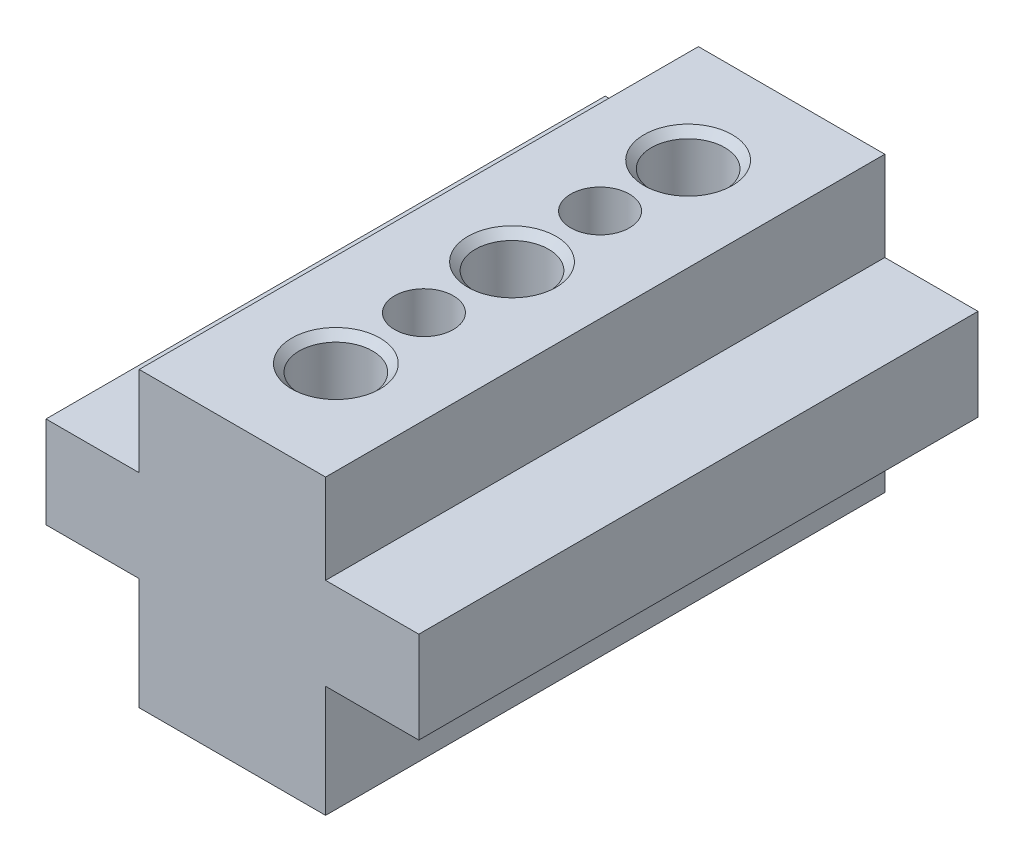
from build123d import *

# Parameters (mm, degrees)
EXTRUDE1_DEPTH            = 9.525
M3X0_5_TAPPED_HOLE1_D     = 2.5
M3X0_5_TAPPED_HOLE1_DEPTH = 6.5024
M3X0_5_TAPPED_HOLE1_TIP   = 0.751075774
HOLE2_D                   = 2
HOLE2_DEPTH               = 4
CHAMFER1_SIZE             = 0.254


with BuildPart() as part:
    # Sketch1 → Extrude1 (new, symmetric)
    with BuildSketch(Plane.XY):
        Polygon((-6.35, -1.5621), (-3.175, -1.5621), (-3.175, -5.3721), (3.175, -5.3721), (3.175, -1.5621), (6.35, -1.5621), (6.35, 1.5621), (3.175, 1.5621), (3.175, 4.6101), (-3.175, 4.6101), (-3.175, 1.5621), (-6.35, 1.5621), align=None)
    extrude(amount=EXTRUDE1_DEPTH, both=True)

    # M3x0.5 Tapped Hole1
    with Locations(Plane(origin=(0, 4.6101, 0), x_dir=(1, 0, 0), z_dir=(0, 1, 0))):
        with Locations((0, 6), (0, 0), (0, -6)):
            Hole(M3X0_5_TAPPED_HOLE1_D / 2, depth=M3X0_5_TAPPED_HOLE1_DEPTH)
            with Locations((0, 0, -(M3X0_5_TAPPED_HOLE1_DEPTH + M3X0_5_TAPPED_HOLE1_TIP / 2))):  # 118° drill point
                Cone(0, M3X0_5_TAPPED_HOLE1_D / 2, M3X0_5_TAPPED_HOLE1_TIP, mode=Mode.SUBTRACT)

    # Hole2
    with Locations(Plane(origin=(0, 4.6101, 0), x_dir=(1, 0, 0), z_dir=(0, 1, 0))):
        with Locations((0, 3), (0, -3)):
            Hole(HOLE2_D / 2, depth=HOLE2_DEPTH)

    # Chamfer1
    chamfer1_edges = [part.edges().sort_by_distance(p)[0] for p in [
        (1.25, 4.6101, 6),
        (1.25, 4.6101, 0),
        (1.25, 4.6101, -6),
    ]]
    chamfer(chamfer1_edges, length=CHAMFER1_SIZE)


solid = part.part
